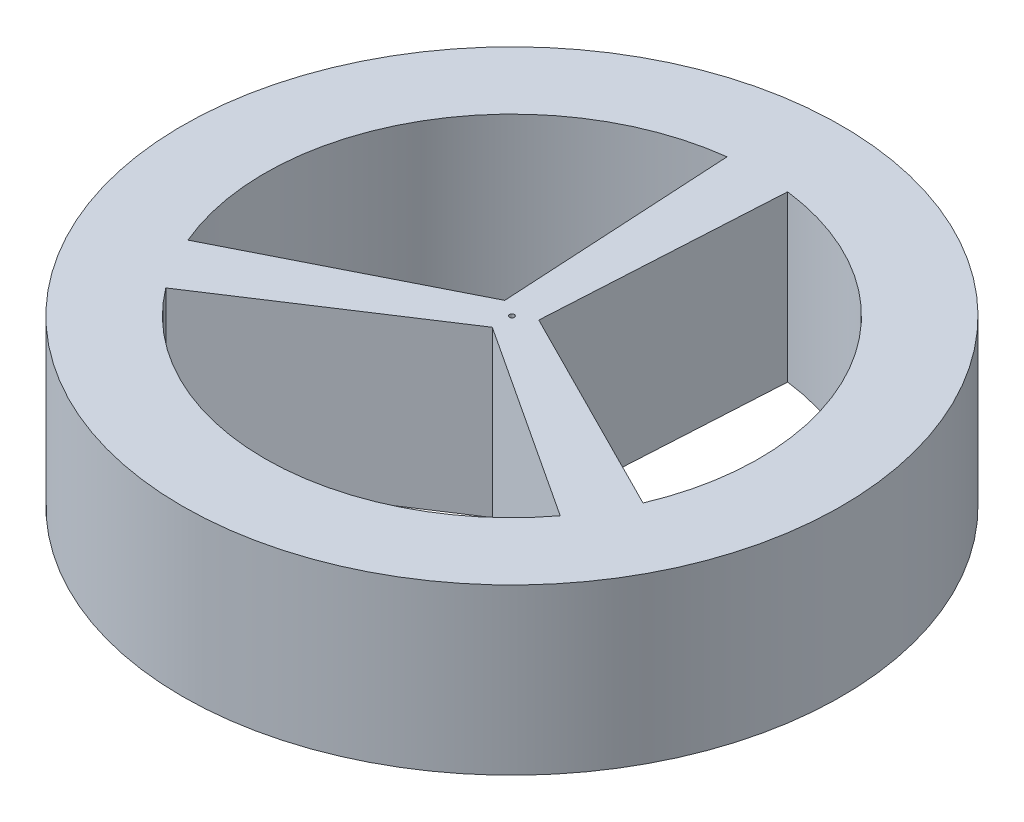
from build123d import *

# Parameters (mm, degrees)
ESQUISSE1_R        = 20
ESQUISSE1_R_2      = 0.15
BOSS_EXTRU_2_DEPTH = 10


with BuildPart() as part:
    # Esquisse1 → Boss.-Extru.2 (new body)
    with BuildSketch(Plane(origin=(0, 0, 0), x_dir=(1, 0, 0), z_dir=(0, 1, 0))):
        with Locations(Location((0, 0, 0), (0, 0, 270))):
            Circle(ESQUISSE1_R)
        with BuildLine():
            Line((-11.975912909, -9.032026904), (-0.000325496, -1.193509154))
            Line((-0.000325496, -1.193509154), (11.970541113, -9.039145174))
            ThreePointArc((11.970541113, -9.039145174), (-0.004458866, -14.999999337), (-11.975912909, -9.032026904))
        make_face(mode=Mode.SUBTRACT)
        with BuildLine():
            Line((13.809921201, -5.855431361), (1.033771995, 0.59647269))
            Line((1.033771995, 0.59647269), (1.842858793, 14.886365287))
            ThreePointArc((1.842858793, 14.886365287), (12.992609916, 7.496138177), (13.809921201, -5.855431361))
        make_face(mode=Mode.SUBTRACT)
        with BuildLine():
            Line((-1.834008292, 14.887458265), (-1.033446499, 0.597036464))
            Line((-1.033446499, 0.597036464), (-13.813399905, -5.847220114))
            ThreePointArc((-13.813399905, -5.847220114), (-12.98815105, 7.50386116), (-1.834008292, 14.887458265))
        make_face(mode=Mode.SUBTRACT)
        with Locations(Location((0, 0, 0), (0, 0, 270))):
            Circle(ESQUISSE1_R_2, mode=Mode.SUBTRACT)
    extrude(amount=BOSS_EXTRU_2_DEPTH)


solid = part.part
